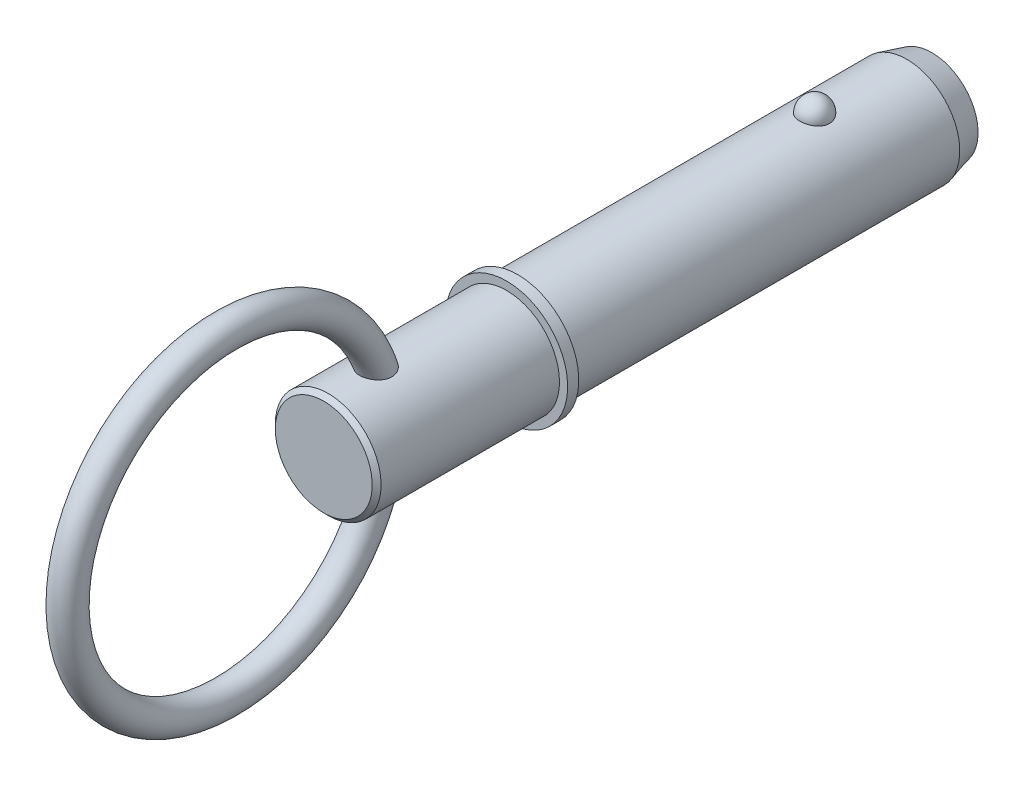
ISO-10303-21;
HEADER;
FILE_DESCRIPTION(('STEP AP214'),'2;1');
FILE_NAME('part.step','',(''),(''),'','','');
FILE_SCHEMA(('AUTOMOTIVE_DESIGN { 1 0 10303 214 1 1 1 1 }'));
ENDSEC;
DATA;
#1=APPLICATION_CONTEXT('core data for automotive mechanical design processes');
#2=APPLICATION_PROTOCOL_DEFINITION('international standard','automotive_design',2000,#1);
#3=PRODUCT_CONTEXT('',#1,'mechanical');
#4=PRODUCT('Part','Part','',(#3));
#5=PRODUCT_RELATED_PRODUCT_CATEGORY('part','',(#4));
#6=PRODUCT_DEFINITION_FORMATION('','',#4);
#7=PRODUCT_DEFINITION_CONTEXT('part definition',#1,'design');
#8=PRODUCT_DEFINITION('design','',#6,#7);
#9=PRODUCT_DEFINITION_SHAPE('','',#8);
#10=(LENGTH_UNIT() NAMED_UNIT(*) SI_UNIT(.MILLI.,.METRE.));
#11=(NAMED_UNIT(*) PLANE_ANGLE_UNIT() SI_UNIT($,.RADIAN.));
#12=(NAMED_UNIT(*) SI_UNIT($,.STERADIAN.) SOLID_ANGLE_UNIT());
#13=UNCERTAINTY_MEASURE_WITH_UNIT(LENGTH_MEASURE(1.E-05),#10,'distance_accuracy_value','');
#14=(GEOMETRIC_REPRESENTATION_CONTEXT(3) GLOBAL_UNCERTAINTY_ASSIGNED_CONTEXT((#13)) GLOBAL_UNIT_ASSIGNED_CONTEXT((#10,
#11,#12)) REPRESENTATION_CONTEXT('',''));
#15=CARTESIAN_POINT('',(0.,0.,0.));
#16=DIRECTION('',(0.,0.,1.));
#17=DIRECTION('',(1.,0.,0.));
#18=AXIS2_PLACEMENT_3D('',#15,#16,#17);
#19=CARTESIAN_POINT('',(0.,0.,50.8));
#20=DIRECTION('',(0.,0.,-1.));
#21=DIRECTION('',(-1.,0.,0.));
#22=AXIS2_PLACEMENT_3D('',#19,#20,#21);
#23=CYLINDRICAL_SURFACE('',#22,9.525);
#24=CARTESIAN_POINT('',(2.66304631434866,9.14515223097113,-2.69));
#25=CARTESIAN_POINT('',(2.66304388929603,9.14515434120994,-2.53964785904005));
#26=CARTESIAN_POINT('',(2.65079171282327,9.14874785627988,-2.389265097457));
#27=CARTESIAN_POINT('',(2.60207590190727,9.16272073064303,-2.09276319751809));
#28=CARTESIAN_POINT('',(2.5656035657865,9.17310252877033,-1.94664561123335));
#29=CARTESIAN_POINT('',(2.469373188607,9.19947238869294,-1.66290124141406));
#30=CARTESIAN_POINT('',(2.40962536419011,9.215457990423,-1.52527076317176));
#31=CARTESIAN_POINT('',(2.26832639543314,9.25124900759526,-1.26225231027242));
#32=CARTESIAN_POINT('',(2.1867756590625,9.27105435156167,-1.1368641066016));
#33=CARTESIAN_POINT('',(2.00344089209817,9.3123948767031,-0.901158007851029));
#34=CARTESIAN_POINT('',(1.90155748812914,9.33393823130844,-0.790918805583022));
#35=CARTESIAN_POINT('',(1.68043702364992,9.37626794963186,-0.589299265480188));
#36=CARTESIAN_POINT('',(1.56119995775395,9.397054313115,-0.497918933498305));
#37=CARTESIAN_POINT('',(1.30893044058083,9.43549335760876,-0.33681251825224));
#38=CARTESIAN_POINT('',(1.17593917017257,9.45315498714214,-0.267024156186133));
#39=CARTESIAN_POINT('',(0.8995966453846,9.48344056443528,-0.150749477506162));
#40=CARTESIAN_POINT('',(0.756246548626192,9.49606507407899,-0.104260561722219));
#41=CARTESIAN_POINT('',(0.466048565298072,9.51468193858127,-0.0365733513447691));
#42=CARTESIAN_POINT('',(0.319312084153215,9.52079100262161,-0.0149294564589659));
#43=CARTESIAN_POINT('',(0.0241592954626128,9.52611235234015,0.00395337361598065));
#44=CARTESIAN_POINT('',(-0.124256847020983,9.5253253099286,0.00119468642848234));
#45=CARTESIAN_POINT('',(-0.41628168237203,9.51700443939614,-0.0284230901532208));
#46=CARTESIAN_POINT('',(-0.559928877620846,9.50956858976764,-0.0549321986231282));
#47=CARTESIAN_POINT('',(-0.840604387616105,9.48887888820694,-0.130816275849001));
#48=CARTESIAN_POINT('',(-0.977632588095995,9.47562493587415,-0.180191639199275));
#49=CARTESIAN_POINT('',(-1.24212223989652,9.44460733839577,-0.300803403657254));
#50=CARTESIAN_POINT('',(-1.36952298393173,9.42681774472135,-0.372166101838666));
#51=CARTESIAN_POINT('',(-1.61053183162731,9.38864858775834,-0.53472901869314));
#52=CARTESIAN_POINT('',(-1.72413851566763,9.36826875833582,-0.625931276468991));
#53=CARTESIAN_POINT('',(-1.9367483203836,9.32666137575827,-0.827716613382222));
#54=CARTESIAN_POINT('',(-2.03542624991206,9.3054250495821,-0.93864062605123));
#55=CARTESIAN_POINT('',(-2.21301001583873,9.26480083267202,-1.17562728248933));
#56=CARTESIAN_POINT('',(-2.29191442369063,9.24541307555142,-1.30169101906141));
#57=CARTESIAN_POINT('',(-2.4288038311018,9.21040769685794,-1.56709947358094));
#58=CARTESIAN_POINT('',(-2.48653332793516,9.19483682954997,-1.7065822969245));
#59=CARTESIAN_POINT('',(-2.57830950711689,9.16952722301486,-1.9936348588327));
#60=CARTESIAN_POINT('',(-2.61235688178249,9.1597883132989,-2.14120436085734));
#61=CARTESIAN_POINT('',(-2.65582131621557,9.14728131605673,-2.43957517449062));
#62=CARTESIAN_POINT('',(-2.66534248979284,9.14448376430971,-2.59036007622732));
#63=CARTESIAN_POINT('',(-2.659816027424,9.1460926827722,-2.89143694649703));
#64=CARTESIAN_POINT('',(-2.64476907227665,9.15049895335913,-3.04172892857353));
#65=CARTESIAN_POINT('',(-2.59062526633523,9.16597303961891,-3.33676161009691));
#66=CARTESIAN_POINT('',(-2.55165119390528,9.17700684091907,-3.48152666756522));
#67=CARTESIAN_POINT('',(-2.45072334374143,9.20447158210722,-3.76226728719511));
#68=CARTESIAN_POINT('',(-2.38876863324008,9.22090274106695,-3.89824249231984));
#69=CARTESIAN_POINT('',(-2.24300082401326,9.25744165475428,-4.15838266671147));
#70=CARTESIAN_POINT('',(-2.15906901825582,9.27756919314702,-4.28247834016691));
#71=CARTESIAN_POINT('',(-1.97161008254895,9.31920445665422,-4.51460755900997));
#72=CARTESIAN_POINT('',(-1.86808218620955,9.34071223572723,-4.62264047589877));
#73=CARTESIAN_POINT('',(-1.64365852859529,9.38280712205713,-4.82005417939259));
#74=CARTESIAN_POINT('',(-1.52269814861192,9.40339041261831,-4.90936239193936));
#75=CARTESIAN_POINT('',(-1.26696810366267,9.44124442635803,-5.06628635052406));
#76=CARTESIAN_POINT('',(-1.13219941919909,9.45851538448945,-5.13390363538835));
#77=CARTESIAN_POINT('',(-0.854427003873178,9.48761400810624,-5.24478918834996));
#78=CARTESIAN_POINT('',(-0.711548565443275,9.49950757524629,-5.28835378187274));
#79=CARTESIAN_POINT('',(-0.420167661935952,9.51684639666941,-5.35116010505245));
#80=CARTESIAN_POINT('',(-0.271665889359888,9.52229244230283,-5.3704048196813));
#81=CARTESIAN_POINT('',(0.0236961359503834,9.52609381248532,-5.38387805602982));
#82=CARTESIAN_POINT('',(0.170533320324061,9.52458300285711,-5.37857884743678));
#83=CARTESIAN_POINT('',(0.461166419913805,9.51494050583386,-5.34419624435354));
#84=CARTESIAN_POINT('',(0.604962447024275,9.50680906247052,-5.31511372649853));
#85=CARTESIAN_POINT('',(0.884899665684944,9.48484202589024,-5.23415185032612));
#86=CARTESIAN_POINT('',(1.02106863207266,9.47102889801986,-5.18236222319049));
#87=CARTESIAN_POINT('',(1.28268503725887,9.43915933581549,-5.05742910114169));
#88=CARTESIAN_POINT('',(1.40813178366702,9.421102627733,-4.98428422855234));
#89=CARTESIAN_POINT('',(1.64690915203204,9.38233399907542,-4.81729201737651));
#90=CARTESIAN_POINT('',(1.76002050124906,9.36158508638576,-4.72313982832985));
#91=CARTESIAN_POINT('',(1.96897358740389,9.31987907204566,-4.5173244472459));
#92=CARTESIAN_POINT('',(2.06481234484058,9.29892193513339,-4.40565824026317));
#93=CARTESIAN_POINT('',(2.23837433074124,9.25869342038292,-4.16566572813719));
#94=CARTESIAN_POINT('',(2.31574652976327,9.23945848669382,-4.03707931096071));
#95=CARTESIAN_POINT('',(2.44818540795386,9.20525491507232,-3.76840633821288));
#96=CARTESIAN_POINT('',(2.50325979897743,9.19028480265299,-3.62832377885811));
#97=CARTESIAN_POINT('',(2.58510224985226,9.16757716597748,-3.35610038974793));
#98=CARTESIAN_POINT('',(2.61427951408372,9.15923447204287,-3.22472833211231));
#99=CARTESIAN_POINT('',(2.6532524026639,9.14802112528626,-2.95891229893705));
#100=CARTESIAN_POINT('',(2.66304848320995,9.1451503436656,-2.82446839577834));
#101=CARTESIAN_POINT('',(2.66304631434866,9.14515223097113,-2.69));
#102=B_SPLINE_CURVE_WITH_KNOTS('',3,(#24,#25,#26,#27,#28,#29,#30,#31,#32,#33,#34,#35,#36,#37,
#38,#39,#40,#41,#42,#43,#44,#45,#46,#47,#48,#49,#50,#51,#52,#53,#54,#55,#56,#57,#58,#59,#60,#61,
#62,#63,#64,#65,#66,#67,#68,#69,#70,#71,#72,#73,#74,#75,#76,#77,#78,#79,#80,#81,#82,#83,#84,#85,
#86,#87,#88,#89,#90,#91,#92,#93,#94,#95,#96,#97,#98,#99,#100,#101),.UNSPECIFIED.,.T.,.F.,(4,2,2,
2,2,2,2,2,2,2,2,2,2,2,2,2,2,2,2,2,2,2,2,2,2,2,2,2,2,2,2,2,2,2,2,2,2,2,4),(0.,0.450573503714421,
0.901308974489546,1.35184682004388,1.80237623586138,2.25516399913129,2.70795190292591,
3.15942136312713,3.61084044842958,4.0540301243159,4.49717661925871,4.9338984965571,
5.37062791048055,5.80991423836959,6.24924573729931,6.69708004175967,7.1449466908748,
7.5980522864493,8.0511446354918,8.50231041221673,8.95346368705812,9.40232106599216,
9.85119666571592,10.3025487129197,10.7539184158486,11.2070064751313,11.6600623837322,
12.1074045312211,12.5546917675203,12.9934085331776,13.4321091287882,13.8690915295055,
14.3061021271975,14.7499227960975,15.1938199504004,15.6455814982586,16.0971866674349,
16.5001694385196,16.9031427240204),.UNSPECIFIED.);
#103=CARTESIAN_POINT('',(2.66304631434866,9.14515223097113,-2.69));
#104=VERTEX_POINT('',#103);
#105=EDGE_CURVE('E102',#104,#104,#102,.T.);
#106=ORIENTED_EDGE('',*,*,#105,.T.);
#107=EDGE_LOOP('',(#106));
#108=FACE_BOUND('',#107,.T.);
#109=CARTESIAN_POINT('',(0.,0.,-19.2999999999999));
#110=DIRECTION('',(0.,0.,-1.));
#111=DIRECTION('',(-1.,0.,0.));
#112=AXIS2_PLACEMENT_3D('',#109,#110,#111);
#113=CIRCLE('',#112,9.525);
#114=CARTESIAN_POINT('',(-9.525,0.,-19.2999999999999));
#115=VERTEX_POINT('',#114);
#116=EDGE_CURVE('E110',#115,#115,#113,.F.);
#117=ORIENTED_EDGE('',*,*,#116,.T.);
#118=EDGE_LOOP('',(#117));
#119=FACE_BOUND('',#118,.T.);
#120=CARTESIAN_POINT('',(0.,0.,50.8));
#121=DIRECTION('',(0.,0.,1.));
#122=DIRECTION('',(1.,0.,0.));
#123=AXIS2_PLACEMENT_3D('',#120,#121,#122);
#124=CIRCLE('',#123,9.525);
#125=CARTESIAN_POINT('',(9.525,0.,50.8));
#126=VERTEX_POINT('',#125);
#127=EDGE_CURVE('E108',#126,#126,#124,.T.);
#128=ORIENTED_EDGE('',*,*,#127,.F.);
#129=EDGE_LOOP('',(#128));
#130=FACE_BOUND('',#129,.T.);
#131=ADVANCED_FACE('F39',(#108,#119,#130),#23,.T.);
#132=CARTESIAN_POINT('',(0.,0.,-23.8));
#133=DIRECTION('',(0.,0.,-1.));
#134=DIRECTION('',(-1.,0.,0.));
#135=AXIS2_PLACEMENT_3D('',#132,#133,#134);
#136=PLANE('',#135);
#137=CARTESIAN_POINT('',(0.,0.,-23.8));
#138=DIRECTION('',(0.,0.,-1.));
#139=DIRECTION('',(-1.,0.,0.));
#140=AXIS2_PLACEMENT_3D('',#137,#138,#139);
#141=CIRCLE('',#140,8.31922863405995);
#142=CARTESIAN_POINT('',(-8.31922863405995,0.,-23.8));
#143=VERTEX_POINT('',#142);
#144=EDGE_CURVE('E142',#143,#143,#141,.T.);
#145=ORIENTED_EDGE('',*,*,#144,.T.);
#146=EDGE_LOOP('',(#145));
#147=FACE_BOUND('',#146,.T.);
#148=ADVANCED_FACE('F88',(#147),#136,.T.);
#149=CARTESIAN_POINT('',(0.,0.,-23.8));
#150=DIRECTION('',(0.,0.,1.));
#151=DIRECTION('',(1.,0.,0.));
#152=AXIS2_PLACEMENT_3D('',#149,#150,#151);
#153=CONICAL_SURFACE('',#152,8.31922863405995,0.261799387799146);
#154=ORIENTED_EDGE('',*,*,#116,.F.);
#155=EDGE_LOOP('',(#154));
#156=FACE_BOUND('',#155,.T.);
#157=ORIENTED_EDGE('',*,*,#144,.F.);
#158=EDGE_LOOP('',(#157));
#159=FACE_BOUND('',#158,.T.);
#160=ADVANCED_FACE('F94',(#156,#159),#153,.T.);
#161=CARTESIAN_POINT('',(0.,9.525,-2.69));
#162=DIRECTION('',(0.,1.,0.));
#163=DIRECTION('',(0.,0.,1.));
#164=AXIS2_PLACEMENT_3D('',#161,#162,#163);
#165=SPHERICAL_SURFACE('',#164,2.69);
#166=ORIENTED_EDGE('',*,*,#105,.F.);
#167=EDGE_LOOP('',(#166));
#168=FACE_BOUND('',#167,.T.);
#169=ADVANCED_FACE('F113',(#168),#165,.T.);
#170=CARTESIAN_POINT('',(0.,0.,50.8));
#171=DIRECTION('',(0.,0.,-1.));
#172=DIRECTION('',(-1.,0.,0.));
#173=AXIS2_PLACEMENT_3D('',#170,#171,#172);
#174=PLANE('',#173);
#175=ORIENTED_EDGE('',*,*,#127,.T.);
#176=EDGE_LOOP('',(#175));
#177=FACE_BOUND('',#176,.T.);
#178=CARTESIAN_POINT('',(0.,0.,50.8));
#179=DIRECTION('',(0.,0.,-1.));
#180=DIRECTION('',(-1.,0.,0.));
#181=AXIS2_PLACEMENT_3D('',#178,#179,#180);
#182=CIRCLE('',#181,11.);
#183=CARTESIAN_POINT('',(-11.,0.,50.8));
#184=VERTEX_POINT('',#183);
#185=EDGE_CURVE('E109',#184,#184,#182,.T.);
#186=ORIENTED_EDGE('',*,*,#185,.T.);
#187=EDGE_LOOP('',(#186));
#188=FACE_BOUND('',#187,.T.);
#189=ADVANCED_FACE('F117',(#177,#188),#174,.T.);
#190=CARTESIAN_POINT('',(0.,0.,33.7287874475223));
#191=DIRECTION('',(0.,0.,-1.));
#192=DIRECTION('',(-1.,0.,0.));
#193=AXIS2_PLACEMENT_3D('',#190,#191,#192);
#194=CYLINDRICAL_SURFACE('',#193,11.);
#195=CARTESIAN_POINT('',(0.,0.,52.8));
#196=DIRECTION('',(0.,0.,-1.));
#197=DIRECTION('',(-1.,0.,0.));
#198=AXIS2_PLACEMENT_3D('',#195,#196,#197);
#199=CIRCLE('',#198,11.);
#200=CARTESIAN_POINT('',(-11.,0.,52.8));
#201=VERTEX_POINT('',#200);
#202=EDGE_CURVE('E134',#201,#201,#199,.T.);
#203=ORIENTED_EDGE('',*,*,#202,.T.);
#204=EDGE_LOOP('',(#203));
#205=FACE_BOUND('',#204,.T.);
#206=ORIENTED_EDGE('',*,*,#185,.F.);
#207=EDGE_LOOP('',(#206));
#208=FACE_BOUND('',#207,.T.);
#209=ADVANCED_FACE('F121',(#205,#208),#194,.T.);
#210=CARTESIAN_POINT('',(0.,11.,52.8));
#211=DIRECTION('',(0.,0.,1.));
#212=DIRECTION('',(1.,0.,0.));
#213=AXIS2_PLACEMENT_3D('',#210,#211,#212);
#214=PLANE('',#213);
#215=CARTESIAN_POINT('',(0.,0.,52.8));
#216=DIRECTION('',(0.,0.,1.));
#217=DIRECTION('',(1.,0.,0.));
#218=AXIS2_PLACEMENT_3D('',#215,#216,#217);
#219=CIRCLE('',#218,9.525);
#220=CARTESIAN_POINT('',(9.525,0.,52.8));
#221=VERTEX_POINT('',#220);
#222=EDGE_CURVE('E112',#221,#221,#219,.T.);
#223=ORIENTED_EDGE('',*,*,#222,.F.);
#224=EDGE_LOOP('',(#223));
#225=FACE_BOUND('',#224,.T.);
#226=ORIENTED_EDGE('',*,*,#202,.F.);
#227=EDGE_LOOP('',(#226));
#228=FACE_BOUND('',#227,.T.);
#229=ADVANCED_FACE('F85',(#225,#228),#214,.T.);
#230=CARTESIAN_POINT('',(0.,0.,85.73));
#231=DIRECTION('',(0.,0.,-1.));
#232=DIRECTION('',(-1.,0.,0.));
#233=AXIS2_PLACEMENT_3D('',#230,#231,#232);
#234=CYLINDRICAL_SURFACE('',#233,9.525);
#235=CARTESIAN_POINT('',(-1.17255022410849,-9.45255262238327,73.7156813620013));
#236=CARTESIAN_POINT('',(-1.03279041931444,-9.46988901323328,73.6520581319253));
#237=CARTESIAN_POINT('',(-0.887457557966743,-9.48474288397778,73.6000360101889));
#238=CARTESIAN_POINT('',(-0.58979004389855,-9.50789357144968,73.5203017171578));
#239=CARTESIAN_POINT('',(-0.437456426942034,-9.51619135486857,73.4925859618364));
#240=CARTESIAN_POINT('',(-0.130095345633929,-9.52535230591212,73.462037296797));
#241=CARTESIAN_POINT('',(0.0249321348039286,-9.52621542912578,73.4592045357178));
#242=CARTESIAN_POINT('',(0.33329175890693,-9.5204161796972,73.4784804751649));
#243=CARTESIAN_POINT('',(0.48662384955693,-9.51375357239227,73.5005899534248));
#244=CARTESIAN_POINT('',(0.787326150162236,-9.49360162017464,73.5693091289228));
#245=CARTESIAN_POINT('',(0.934692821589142,-9.48010828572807,73.6159331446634));
#246=CARTESIAN_POINT('',(1.2191706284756,-9.44773819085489,73.732695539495));
#247=CARTESIAN_POINT('',(1.35628163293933,-9.42886136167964,73.8028342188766));
#248=CARTESIAN_POINT('',(1.61597534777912,-9.38783836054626,73.9648586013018));
#249=CARTESIAN_POINT('',(1.73859309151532,-9.36570037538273,74.0566901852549));
#250=CARTESIAN_POINT('',(1.96611924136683,-9.32059424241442,74.2599834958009));
#251=CARTESIAN_POINT('',(2.07103000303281,-9.29762620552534,74.3714426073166));
#252=CARTESIAN_POINT('',(2.25895856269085,-9.25375378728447,74.609567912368));
#253=CARTESIAN_POINT('',(2.34223089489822,-9.23282741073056,74.7360291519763));
#254=CARTESIAN_POINT('',(2.48638570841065,-9.19505802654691,75.0016544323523));
#255=CARTESIAN_POINT('',(2.54727152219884,-9.17821441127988,75.1408165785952));
#256=CARTESIAN_POINT('',(2.64504150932,-9.15051673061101,75.4264509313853));
#257=CARTESIAN_POINT('',(2.68213620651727,-9.13961026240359,75.57284631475));
#258=CARTESIAN_POINT('',(2.73308631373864,-9.1245038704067,75.8699359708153));
#259=CARTESIAN_POINT('',(2.74693762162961,-9.12030513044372,76.0206309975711));
#260=CARTESIAN_POINT('',(2.75225289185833,-9.11870262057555,76.3282041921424));
#261=CARTESIAN_POINT('',(2.742835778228,-9.12156626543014,76.4850973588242));
#262=CARTESIAN_POINT('',(2.70120500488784,-9.13397864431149,76.7955303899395));
#263=CARTESIAN_POINT('',(2.66898313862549,-9.14352978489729,76.9490690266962));
#264=CARTESIAN_POINT('',(2.57915721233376,-9.1692947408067,77.2643171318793));
#265=CARTESIAN_POINT('',(2.51938387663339,-9.18606757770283,77.4253627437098));
#266=CARTESIAN_POINT('',(2.37615490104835,-9.22415241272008,77.7361129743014));
#267=CARTESIAN_POINT('',(2.29267648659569,-9.2454687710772,77.8858065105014));
#268=CARTESIAN_POINT('',(2.09570343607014,-9.29218719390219,78.1820058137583));
#269=CARTESIAN_POINT('',(1.98029238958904,-9.31778152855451,78.3272155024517));
#270=CARTESIAN_POINT('',(1.72523060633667,-9.36835235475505,78.594631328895));
#271=CARTESIAN_POINT('',(1.58560973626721,-9.39332956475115,78.7168654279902));
#272=CARTESIAN_POINT('',(1.31999418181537,-9.4338116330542,78.906542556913));
#273=CARTESIAN_POINT('',(1.1984987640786,-9.45016352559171,78.9801115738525));
#274=CARTESIAN_POINT('',(0.944726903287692,-9.47889043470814,79.1065550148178));
#275=CARTESIAN_POINT('',(0.812460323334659,-9.4912690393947,79.1594481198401));
#276=CARTESIAN_POINT('',(0.539385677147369,-9.51070487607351,79.2415791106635));
#277=CARTESIAN_POINT('',(0.398529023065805,-9.51772807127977,79.270665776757));
#278=CARTESIAN_POINT('',(0.113692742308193,-9.52538430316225,79.3023462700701));
#279=CARTESIAN_POINT('',(-0.0302854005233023,-9.52602031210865,79.3049524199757));
#280=CARTESIAN_POINT('',(-0.301067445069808,-9.52110324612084,79.2846387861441));
#281=CARTESIAN_POINT('',(-0.428091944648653,-9.51619084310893,79.2643615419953));
#282=CARTESIAN_POINT('',(-0.676960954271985,-9.50173118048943,79.2037701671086));
#283=CARTESIAN_POINT('',(-0.798804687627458,-9.49218322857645,79.1634530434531));
#284=CARTESIAN_POINT('',(-1.03743276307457,-9.4691126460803,79.0637974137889));
#285=CARTESIAN_POINT('',(-1.15402581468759,-9.45550022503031,79.0040261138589));
#286=CARTESIAN_POINT('',(-1.37707059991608,-9.42560278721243,78.8684655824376));
#287=CARTESIAN_POINT('',(-1.48351822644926,-9.40931669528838,78.7926699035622));
#288=CARTESIAN_POINT('',(-1.70022776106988,-9.37276249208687,78.6152067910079));
#289=CARTESIAN_POINT('',(-1.80866644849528,-9.35226352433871,78.5113639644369));
#290=CARTESIAN_POINT('',(-2.00947431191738,-9.31118474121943,78.2891646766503));
#291=CARTESIAN_POINT('',(-2.10183201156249,-9.29060487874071,78.170797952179));
#292=CARTESIAN_POINT('',(-2.28343646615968,-9.24779116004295,77.9017233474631));
#293=CARTESIAN_POINT('',(-2.36963977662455,-9.22584708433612,77.7489048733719));
#294=CARTESIAN_POINT('',(-2.51731958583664,-9.18665215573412,77.4311082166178));
#295=CARTESIAN_POINT('',(-2.57878214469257,-9.16940395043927,77.2661232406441));
#296=CARTESIAN_POINT('',(-2.67771284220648,-9.14102404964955,76.9179062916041));
#297=CARTESIAN_POINT('',(-2.71355979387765,-9.13031106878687,76.7341717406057));
#298=CARTESIAN_POINT('',(-2.75239325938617,-9.11868499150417,76.3629391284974));
#299=CARTESIAN_POINT('',(-2.75540326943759,-9.11776488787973,76.1754438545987));
#300=CARTESIAN_POINT('',(-2.72755769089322,-9.12612848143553,75.8182334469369));
#301=CARTESIAN_POINT('',(-2.69938579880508,-9.1346036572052,75.6482935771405));
#302=CARTESIAN_POINT('',(-2.6128234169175,-9.15973790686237,75.3169419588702));
#303=CARTESIAN_POINT('',(-2.55445306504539,-9.17639152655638,75.1555246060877));
#304=CARTESIAN_POINT('',(-2.41575064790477,-9.21381352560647,74.8622621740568));
#305=CARTESIAN_POINT('',(-2.33810564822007,-9.23402440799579,74.7290677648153));
#306=CARTESIAN_POINT('',(-2.16110598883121,-9.27704240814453,74.4784363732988));
#307=CARTESIAN_POINT('',(-2.06174995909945,-9.29984968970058,74.36100038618));
#308=CARTESIAN_POINT('',(-1.84046167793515,-9.34620233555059,74.1414448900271));
#309=CARTESIAN_POINT('',(-1.71787459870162,-9.36974632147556,74.0399849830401));
#310=CARTESIAN_POINT('',(-1.45637301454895,-9.41393415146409,73.8600854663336));
#311=CARTESIAN_POINT('',(-1.31745717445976,-9.43457775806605,73.7816477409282));
#312=CARTESIAN_POINT('',(-1.17255022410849,-9.45255262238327,73.7156813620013));
#313=B_SPLINE_CURVE_WITH_KNOTS('',3,(#235,#236,#237,#238,#239,#240,#241,#242,#243,#244,#245,
#246,#247,#248,#249,#250,#251,#252,#253,#254,#255,#256,#257,#258,#259,#260,#261,#262,#263,#264,
#265,#266,#267,#268,#269,#270,#271,#272,#273,#274,#275,#276,#277,#278,#279,#280,#281,#282,#283,
#284,#285,#286,#287,#288,#289,#290,#291,#292,#293,#294,#295,#296,#297,#298,#299,#300,#301,#302,
#303,#304,#305,#306,#307,#308,#309,#310,#311,#312),.UNSPECIFIED.,.T.,.F.,(4,2,2,2,2,2,2,2,2,2,2,
2,2,2,2,2,2,2,2,2,2,2,2,2,2,2,2,2,2,2,2,2,2,2,2,2,2,2,4),(0.,0.463035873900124,
0.926003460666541,1.38897381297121,1.85195860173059,2.31521411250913,2.77847553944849,
3.24059321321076,3.70264936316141,4.15899535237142,4.61527338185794,5.06745604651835,
5.51971850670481,5.98936669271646,6.45918397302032,6.97482863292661,7.49097038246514,
8.04995658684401,8.60825803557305,9.03545685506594,9.46226879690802,9.89177127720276,
10.3210738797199,10.7054535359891,11.0898906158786,11.4835430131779,11.877354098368,
12.3302409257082,12.7834496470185,13.3116493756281,13.8401462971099,14.3996817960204,
14.9588168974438,15.4733264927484,15.9874934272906,16.4516692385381,16.915874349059,
17.3959238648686,17.8760126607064),.UNSPECIFIED.);
#314=CARTESIAN_POINT('',(-1.17255022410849,-9.45255262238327,73.7156813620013));
#315=VERTEX_POINT('',#314);
#316=EDGE_CURVE('E10',#315,#315,#313,.T.);
#317=ORIENTED_EDGE('',*,*,#316,.F.);
#318=EDGE_LOOP('',(#317));
#319=FACE_BOUND('',#318,.T.);
#320=CARTESIAN_POINT('',(-1.17255022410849,9.45255262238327,73.7156813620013));
#321=CARTESIAN_POINT('',(-1.31058061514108,9.43543238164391,73.7785143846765));
#322=CARTESIAN_POINT('',(-1.44315063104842,9.41589375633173,73.8526513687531));
#323=CARTESIAN_POINT('',(-1.69365345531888,9.37407591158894,74.0218923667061));
#324=CARTESIAN_POINT('',(-1.81158925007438,9.35179725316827,74.1169920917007));
#325=CARTESIAN_POINT('',(-2.02956633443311,9.30692788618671,74.3259676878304));
#326=CARTESIAN_POINT('',(-2.12959463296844,9.28433696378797,74.4398570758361));
#327=CARTESIAN_POINT('',(-2.30883055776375,9.24139869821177,74.6833457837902));
#328=CARTESIAN_POINT('',(-2.38804080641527,9.22105107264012,74.8129431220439));
#329=CARTESIAN_POINT('',(-2.52289811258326,9.18506690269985,75.0826371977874));
#330=CARTESIAN_POINT('',(-2.57879510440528,9.16938093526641,75.2226025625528));
#331=CARTESIAN_POINT('',(-2.66732862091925,9.14402087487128,75.5101942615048));
#332=CARTESIAN_POINT('',(-2.6999643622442,9.13434698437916,75.6578208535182));
#333=CARTESIAN_POINT('',(-2.74234854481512,9.12171311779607,75.9587097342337));
#334=CARTESIAN_POINT('',(-2.75176419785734,9.11885078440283,76.1120223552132));
#335=CARTESIAN_POINT('',(-2.74768995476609,9.12007747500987,76.418282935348));
#336=CARTESIAN_POINT('',(-2.73419331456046,9.12416854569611,76.5712307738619));
#337=CARTESIAN_POINT('',(-2.6838140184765,9.13911977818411,76.8850489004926));
#338=CARTESIAN_POINT('',(-2.64520186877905,9.15047943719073,77.0456159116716));
#339=CARTESIAN_POINT('',(-2.54485320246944,9.17889121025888,77.3588781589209));
#340=CARTESIAN_POINT('',(-2.48309922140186,9.19594762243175,77.5115673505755));
#341=CARTESIAN_POINT('',(-2.33056913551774,9.23584987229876,77.8211220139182));
#342=CARTESIAN_POINT('',(-2.23745101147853,9.25911216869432,77.9767845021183));
#343=CARTESIAN_POINT('',(-2.02674425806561,9.30750138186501,78.2702795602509));
#344=CARTESIAN_POINT('',(-1.90916388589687,9.33262766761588,78.4081181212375));
#345=CARTESIAN_POINT('',(-1.67044606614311,9.37804498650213,78.6420159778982));
#346=CARTESIAN_POINT('',(-1.55243875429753,9.39849934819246,78.7412400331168));
#347=CARTESIAN_POINT('',(-1.30125310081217,9.43654625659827,78.9191930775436));
#348=CARTESIAN_POINT('',(-1.16808326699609,9.45414039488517,78.9979334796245));
#349=CARTESIAN_POINT('',(-0.958516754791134,9.47691412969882,79.097606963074));
#350=CARTESIAN_POINT('',(-0.886649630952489,9.48392776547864,79.1278606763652));
#351=CARTESIAN_POINT('',(-0.740281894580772,9.49647248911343,79.181484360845));
#352=CARTESIAN_POINT('',(-0.66578274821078,9.50200438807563,79.2048580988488));
#353=CARTESIAN_POINT('',(-0.514804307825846,9.51137811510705,79.2442294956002));
#354=CARTESIAN_POINT('',(-0.43832647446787,9.51522115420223,79.260232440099));
#355=CARTESIAN_POINT('',(-0.284116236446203,9.52107513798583,79.2845321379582));
#356=CARTESIAN_POINT('',(-0.20638405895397,9.52308641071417,79.2928302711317));
#357=CARTESIAN_POINT('',(0.0046395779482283,9.5259225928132,79.3045451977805));
#358=CARTESIAN_POINT('',(0.138460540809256,9.52491109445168,79.3003947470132));
#359=CARTESIAN_POINT('',(0.403152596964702,9.51738801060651,79.2692519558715));
#360=CARTESIAN_POINT('',(0.534023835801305,9.51087669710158,79.242260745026));
#361=CARTESIAN_POINT('',(0.783985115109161,9.49347484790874,79.1688065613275));
#362=CARTESIAN_POINT('',(0.903337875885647,9.48277338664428,79.1231810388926));
#363=CARTESIAN_POINT('',(1.13363663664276,9.45800893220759,79.0149289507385));
#364=CARTESIAN_POINT('',(1.24458027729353,9.44394500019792,78.9522976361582));
#365=CARTESIAN_POINT('',(1.46880911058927,9.41182796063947,78.804389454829));
#366=CARTESIAN_POINT('',(1.58087386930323,9.3935013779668,78.7173287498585));
#367=CARTESIAN_POINT('',(1.79132420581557,9.35565274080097,78.5282478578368));
#368=CARTESIAN_POINT('',(1.88970126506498,9.33612995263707,78.4262184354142));
#369=CARTESIAN_POINT('',(2.08778125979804,9.29401761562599,78.1909975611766));
#370=CARTESIAN_POINT('',(2.18473298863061,9.27148591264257,78.05547341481));
#371=CARTESIAN_POINT('',(2.35733954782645,9.22911075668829,77.7710303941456));
#372=CARTESIAN_POINT('',(2.43297838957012,9.2092693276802,77.6221015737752));
#373=CARTESIAN_POINT('',(2.56843139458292,9.17247322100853,77.2972697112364));
#374=CARTESIAN_POINT('',(2.62561924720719,9.15606955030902,77.1201963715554));
#375=CARTESIAN_POINT('',(2.70930664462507,9.13166037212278,76.7583301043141));
#376=CARTESIAN_POINT('',(2.73581406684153,9.12365270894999,76.5735391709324));
#377=CARTESIAN_POINT('',(2.7551261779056,9.11784049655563,76.2090170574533));
#378=CARTESIAN_POINT('',(2.74917791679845,9.11965839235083,76.0293617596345));
#379=CARTESIAN_POINT('',(2.70473277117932,9.13294027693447,75.6744999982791));
#380=CARTESIAN_POINT('',(2.66626406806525,9.14439591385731,75.4992898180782));
#381=CARTESIAN_POINT('',(2.5626384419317,9.17393184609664,75.1784698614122));
#382=CARTESIAN_POINT('',(2.50080069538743,9.19116614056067,75.0317041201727));
#383=CARTESIAN_POINT('',(2.35244847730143,9.23024728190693,74.7518999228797));
#384=CARTESIAN_POINT('',(2.26593972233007,9.25209305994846,74.6188582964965));
#385=CARTESIAN_POINT('',(2.07585352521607,9.29652853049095,74.377145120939));
#386=CARTESIAN_POINT('',(1.97340753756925,9.31901931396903,74.2675620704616));
#387=CARTESIAN_POINT('',(1.7514233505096,9.36327537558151,74.067179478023));
#388=CARTESIAN_POINT('',(1.63188535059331,9.38504066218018,73.9763797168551));
#389=CARTESIAN_POINT('',(1.3782626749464,9.42563474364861,73.8151683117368));
#390=CARTESIAN_POINT('',(1.24409194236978,9.44444438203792,73.7448873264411));
#391=CARTESIAN_POINT('',(0.965562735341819,9.47697010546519,73.6269968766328));
#392=CARTESIAN_POINT('',(0.821203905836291,9.4906860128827,73.5793882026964));
#393=CARTESIAN_POINT('',(0.524366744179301,9.51173338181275,73.5073692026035));
#394=CARTESIAN_POINT('',(0.37180751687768,9.5189799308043,73.4832670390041));
#395=CARTESIAN_POINT('',(0.0646112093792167,9.52602042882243,73.4598425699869));
#396=CARTESIAN_POINT('',(-0.0900262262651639,9.52581308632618,73.4605245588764));
#397=CARTESIAN_POINT('',(-0.40413981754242,9.51777767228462,73.4872769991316));
#398=CARTESIAN_POINT('',(-0.563508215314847,9.50959696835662,73.5145222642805));
#399=CARTESIAN_POINT('',(-0.874799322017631,9.48602809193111,73.5955333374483));
#400=CARTESIAN_POINT('',(-1.02672214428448,9.47064002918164,73.6492987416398));
#401=CARTESIAN_POINT('',(-1.17255022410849,9.45255262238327,73.7156813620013));
#402=B_SPLINE_CURVE_WITH_KNOTS('',3,(#320,#321,#322,#323,#324,#325,#326,#327,#328,#329,#330,
#331,#332,#333,#334,#335,#336,#337,#338,#339,#340,#341,#342,#343,#344,#345,#346,#347,#348,#349,
#350,#351,#352,#353,#354,#355,#356,#357,#358,#359,#360,#361,#362,#363,#364,#365,#366,#367,#368,
#369,#370,#371,#372,#373,#374,#375,#376,#377,#378,#379,#380,#381,#382,#383,#384,#385,#386,#387,
#388,#389,#390,#391,#392,#393,#394,#395,#396,#397,#398,#399,#400,#401),.UNSPECIFIED.,.T.,.F.,(4,
2,2,2,2,2,2,2,2,2,2,2,2,2,2,2,2,2,2,2,2,2,2,2,2,2,2,2,2,2,2,2,2,2,2,2,2,2,2,2,4),(0.,
0.457306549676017,0.914519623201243,1.37206305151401,1.82954881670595,2.28199545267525,
2.73445732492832,3.19336710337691,3.65241198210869,4.14699278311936,4.64194758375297,
5.18812269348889,5.73411374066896,6.19889752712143,6.66342179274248,6.89799214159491,
7.13243382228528,7.36670711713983,7.6009384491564,8.00032434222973,8.39969048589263,
8.78279802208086,9.16601265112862,9.59366701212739,10.0215863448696,10.5240084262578,
11.0268064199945,11.5844522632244,12.1419548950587,12.678191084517,13.2139630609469,
13.6920531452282,14.1700325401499,14.6229745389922,15.0759112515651,15.5316722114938,
15.9874490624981,16.4491237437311,16.9108784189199,17.3940267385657,17.8771677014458),.UNSPECIFIED.);
#403=CARTESIAN_POINT('',(-1.17255022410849,9.45255262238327,73.7156813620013));
#404=VERTEX_POINT('',#403);
#405=EDGE_CURVE('E51',#404,#404,#402,.T.);
#406=ORIENTED_EDGE('',*,*,#405,.F.);
#407=EDGE_LOOP('',(#406));
#408=FACE_BOUND('',#407,.T.);
#409=CARTESIAN_POINT('',(0.,0.,84.93));
#410=DIRECTION('',(0.,0.,-1.));
#411=DIRECTION('',(-1.,0.,0.));
#412=AXIS2_PLACEMENT_3D('',#409,#410,#411);
#413=CIRCLE('',#412,9.525);
#414=CARTESIAN_POINT('',(-9.525,0.,84.93));
#415=VERTEX_POINT('',#414);
#416=EDGE_CURVE('E64',#415,#415,#413,.T.);
#417=ORIENTED_EDGE('',*,*,#416,.T.);
#418=EDGE_LOOP('',(#417));
#419=FACE_BOUND('',#418,.T.);
#420=ORIENTED_EDGE('',*,*,#222,.T.);
#421=EDGE_LOOP('',(#420));
#422=FACE_BOUND('',#421,.T.);
#423=ADVANCED_FACE('F69',(#319,#408,#419,#422),#234,.T.);
#424=CARTESIAN_POINT('',(0.,0.,85.73));
#425=DIRECTION('',(0.,0.,-1.));
#426=DIRECTION('',(-1.,0.,0.));
#427=AXIS2_PLACEMENT_3D('',#424,#425,#426);
#428=PLANE('',#427);
#429=CARTESIAN_POINT('',(0.,0.,85.73));
#430=DIRECTION('',(0.,0.,-1.));
#431=DIRECTION('',(-1.,0.,0.));
#432=AXIS2_PLACEMENT_3D('',#429,#430,#431);
#433=CIRCLE('',#432,8.725);
#434=CARTESIAN_POINT('',(-8.725,0.,85.73));
#435=VERTEX_POINT('',#434);
#436=EDGE_CURVE('E58',#435,#435,#433,.F.);
#437=ORIENTED_EDGE('',*,*,#436,.T.);
#438=EDGE_LOOP('',(#437));
#439=FACE_BOUND('',#438,.T.);
#440=ADVANCED_FACE('F76',(#439),#428,.F.);
#441=CARTESIAN_POINT('',(0.,0.,84.93));
#442=DIRECTION('',(0.,0.,-1.));
#443=DIRECTION('',(-1.,0.,0.));
#444=AXIS2_PLACEMENT_3D('',#441,#442,#443);
#445=CONICAL_SURFACE('',#444,9.525,0.785398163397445);
#446=ORIENTED_EDGE('',*,*,#436,.F.);
#447=EDGE_LOOP('',(#446));
#448=FACE_BOUND('',#447,.T.);
#449=ORIENTED_EDGE('',*,*,#416,.F.);
#450=EDGE_LOOP('',(#449));
#451=FACE_BOUND('',#450,.T.);
#452=ADVANCED_FACE('F41',(#448,#451),#445,.T.);
#453=CARTESIAN_POINT('',(0.,0.,103.305));
#454=DIRECTION('',(1.,0.,0.));
#455=DIRECTION('',(0.,0.,-1.));
#456=AXIS2_PLACEMENT_3D('',#453,#454,#455);
#457=TOROIDAL_SURFACE('',#456,28.575,2.75);
#458=ORIENTED_EDGE('',*,*,#316,.T.);
#459=EDGE_LOOP('',(#458));
#460=FACE_BOUND('',#459,.T.);
#461=ORIENTED_EDGE('',*,*,#405,.T.);
#462=EDGE_LOOP('',(#461));
#463=FACE_BOUND('',#462,.T.);
#464=ADVANCED_FACE('F73',(#460,#463),#457,.T.);
#465=CLOSED_SHELL('',(#131,#148,#160,#169,#189,#209,#229,#423,#440,#452,#464));
#466=MANIFOLD_SOLID_BREP('B2',#465);
#467=ADVANCED_BREP_SHAPE_REPRESENTATION('',(#18,#466),#14);
#468=SHAPE_DEFINITION_REPRESENTATION(#9,#467);
ENDSEC;
END-ISO-10303-21;
